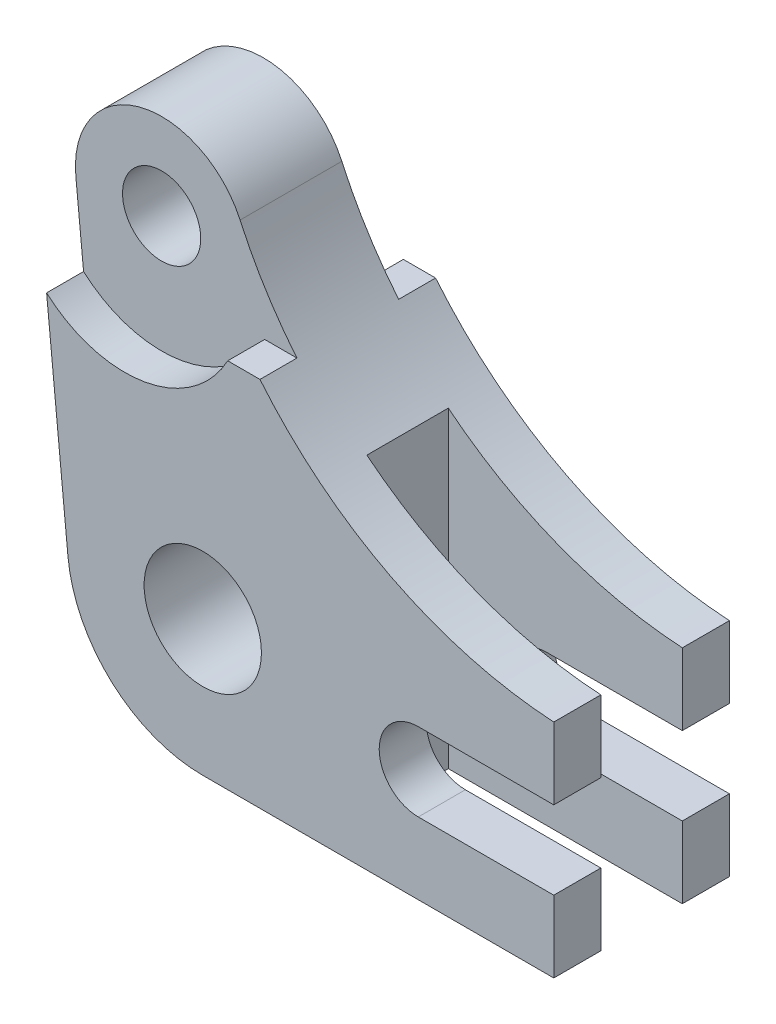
from build123d import *

# Parameters (mm, degrees)
SKETCH1_R           = 6.35
SKETCH1_R_2         = 9.525
BOSS_EXTRUDE1_DEPTH = 14.26
SKETCH2_R           = 6.35
CUT_EXTRUDE1_DEPTH  = 6
CUT_EXTRUDE2_DEPTH  = 6.615


with BuildPart() as part:
    # Sketch1 → Boss-Extrude1 (new, symmetric)
    with BuildSketch(Plane.XY):
        with BuildLine():
            Line((-9.212737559, -49.478535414), (-13.93309958, -1.367017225))
            ThreePointArc((-13.93309958, -1.367017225), (-3.631767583, 13.520734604), (12.742817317, 5.798327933))
            ThreePointArc((12.742817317, 5.798327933), (35.780121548, -21.671074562), (69.68213321, -33.330365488))
            Line((69.68213321, -33.330365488), (69.68213321, -44.980365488))
            Line((69.68213321, -44.980365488), (47.68213321, -44.980365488))
            ThreePointArc((47.68213321, -44.980365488), (41.33213321, -51.330365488), (47.68213321, -57.680365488))
            Line((47.68213321, -57.680365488), (69.68213321, -57.680365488))
            Line((69.68213321, -57.680365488), (69.68213321, -69.330365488))
            Line((69.68213321, -69.330365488), (12.68213321, -69.330365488))
            ThreePointArc((12.68213321, -69.330365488), (-2.095218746, -63.62852088), (-9.212737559, -49.478535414))
        make_face()
        Circle(SKETCH1_R, mode=Mode.SUBTRACT)
        with Locations((12.68213321, -47.330365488)):
            Circle(SKETCH1_R_2, mode=Mode.SUBTRACT)
    extrude(amount=BOSS_EXTRUDE1_DEPTH, both=True)

    # Sketch2 → Cut-Extrude1 (cut)
    with BuildSketch(Plane.XY.offset(14.26)):
        with BuildLine():
            Line((-12.678838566, -14.150867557), (-13.93309958, -1.367017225))
            ThreePointArc((-13.93309958, -1.367017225), (-3.631767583, 13.520734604), (12.742817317, 5.798327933))
            ThreePointArc((12.742817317, 5.798327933), (16.872880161, -1.902335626), (21.970016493, -9))
            Line((21.970016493, -9), (16.733200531, -9))
            ThreePointArc((16.733200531, -9), (3.277548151, -18.715172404), (-12.678838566, -14.150867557))
        make_face()
        Circle(SKETCH2_R, mode=Mode.SUBTRACT)
    cut_extrude1 = extrude(amount=-CUT_EXTRUDE1_DEPTH, mode=Mode.SUBTRACT)

    # Mirror1: Cut-Extrude1 across plane
    add(cut_extrude1.mirror(Plane.XY), mode=Mode.SUBTRACT)

    # Sketch3 → Cut-Extrude2 (cut, symmetric)
    with BuildSketch(Plane.XY):
        with BuildLine():
            Line((31.68213321, -18.618497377), (31.68213321, -69.330365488))
            Line((31.68213321, -69.330365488), (69.68213321, -69.330365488))
            Line((69.68213321, -69.330365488), (69.68213321, -57.680365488))
            Line((69.68213321, -57.680365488), (47.68213321, -57.680365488))
            ThreePointArc((47.68213321, -57.680365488), (41.33213321, -51.330365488), (47.68213321, -44.980365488))
            Line((47.68213321, -44.980365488), (69.68213321, -44.980365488))
            Line((69.68213321, -44.980365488), (69.68213321, -33.330365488))
            ThreePointArc((69.68213321, -33.330365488), (49.536562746, -28.933381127), (31.68213321, -18.618497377))
        make_face()
    extrude(amount=CUT_EXTRUDE2_DEPTH, both=True, mode=Mode.SUBTRACT)


solid = part.part
